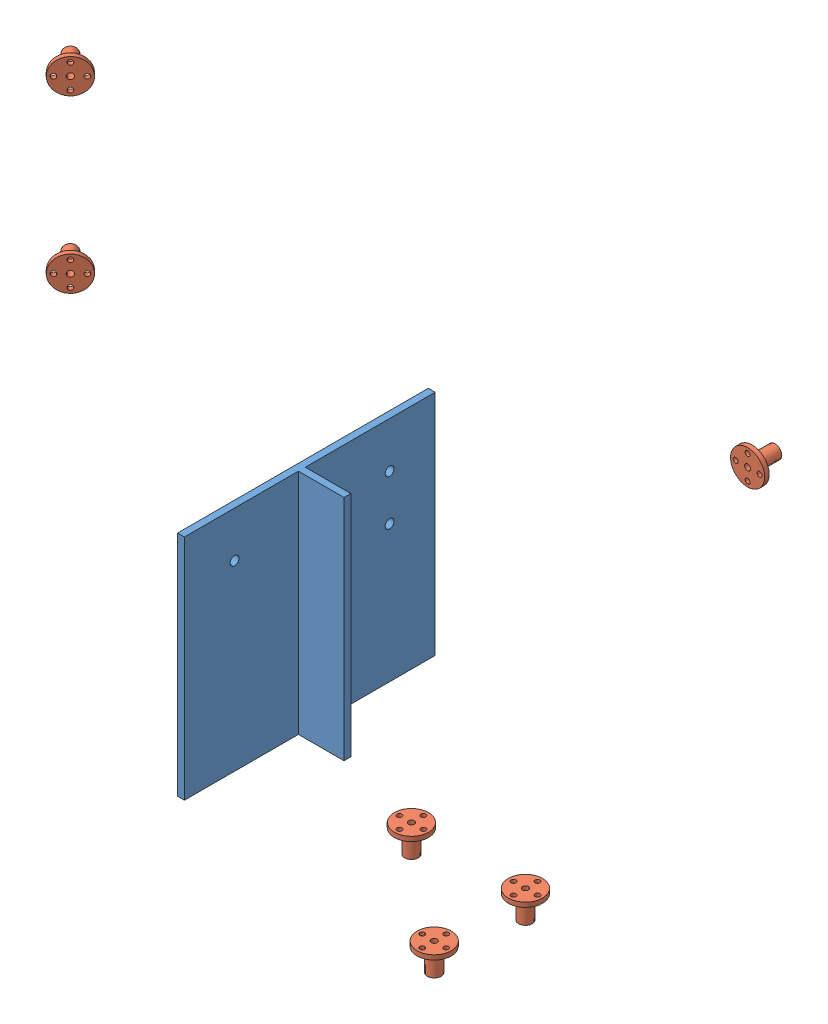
SolidWorks assembly DIN_Assembly.SLDASM, configuration Default (file format 13000). Lengths in mm.
Overall size (3294.85 1195 1699.17).
7 component instances, 2 part files, 0 mates.
Components (placement in the parent):
- Structure1-1: Structure1.SLDPRT [Default<As Machined>] at (1970 -400 0) size (230 1000 1100)
- 25mm_Equipment_Flange-5: 25mm_Equipment_Flange.SLDPRT [Default] at (2970.001 599.7575 -1500) x (-1 0 0) z (0 0 -1) size (150 150 120)
- 25mm_Equipment_Flange-7: 25mm_Equipment_Flange.SLDPRT [Default] at (0 600 -1500) x (-0.707107 0 0.707107) z (-0.707107 0 -0.707107) size (150 150 120)
- 25mm_Equipment_Flange-8: 25mm_Equipment_Flange.SLDPRT [Default] at (0 -150 -1500) x (-0.707107 0 0.707107) z (-0.707107 0 -0.707107) size (150 150 120)
- 25mm_Equipment_Flange-12: 25mm_Equipment_Flange.SLDPRT [Default] at (2581.9632 -400 -413.7115) x (0 0 -1) z (0 -1 0) size (150 150 120)
- 25mm_Equipment_Flange-13: 25mm_Equipment_Flange.SLDPRT [Default] at (3081.9632 -400 -413.7115) x (0 0 -1) z (0 -1 0) size (150 150 120)
- 25mm_Equipment_Flange-14: 25mm_Equipment_Flange.SLDPRT [Default] at (3081.9632 -400 -13.7115) x (0 0 -1) z (0 -1 0) size (150 150 120)
